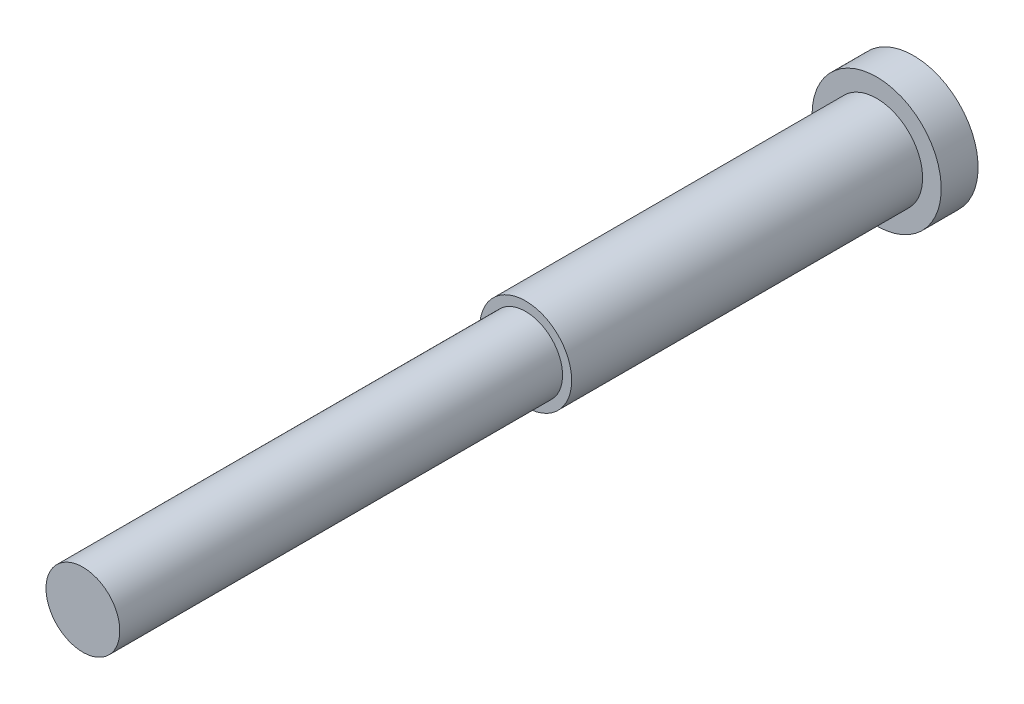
ISO-10303-21;
HEADER;
FILE_DESCRIPTION(('STEP AP214'),'2;1');
FILE_NAME('part.step','',(''),(''),'','','');
FILE_SCHEMA(('AUTOMOTIVE_DESIGN { 1 0 10303 214 1 1 1 1 }'));
ENDSEC;
DATA;
#1=APPLICATION_CONTEXT('core data for automotive mechanical design processes');
#2=APPLICATION_PROTOCOL_DEFINITION('international standard','automotive_design',2000,#1);
#3=PRODUCT_CONTEXT('',#1,'mechanical');
#4=PRODUCT('Part','Part','',(#3));
#5=PRODUCT_RELATED_PRODUCT_CATEGORY('part','',(#4));
#6=PRODUCT_DEFINITION_FORMATION('','',#4);
#7=PRODUCT_DEFINITION_CONTEXT('part definition',#1,'design');
#8=PRODUCT_DEFINITION('design','',#6,#7);
#9=PRODUCT_DEFINITION_SHAPE('','',#8);
#10=(LENGTH_UNIT() NAMED_UNIT(*) SI_UNIT(.MILLI.,.METRE.));
#11=(NAMED_UNIT(*) PLANE_ANGLE_UNIT() SI_UNIT($,.RADIAN.));
#12=(NAMED_UNIT(*) SI_UNIT($,.STERADIAN.) SOLID_ANGLE_UNIT());
#13=UNCERTAINTY_MEASURE_WITH_UNIT(LENGTH_MEASURE(1.E-05),#10,'distance_accuracy_value','');
#14=(GEOMETRIC_REPRESENTATION_CONTEXT(3) GLOBAL_UNCERTAINTY_ASSIGNED_CONTEXT((#13)) GLOBAL_UNIT_ASSIGNED_CONTEXT((#10,
#11,#12)) REPRESENTATION_CONTEXT('',''));
#15=CARTESIAN_POINT('',(0.,0.,0.));
#16=DIRECTION('',(0.,0.,1.));
#17=DIRECTION('',(1.,0.,0.));
#18=AXIS2_PLACEMENT_3D('',#15,#16,#17);
#19=CARTESIAN_POINT('',(0.,0.,60.4012));
#20=DIRECTION('',(0.,0.,1.));
#21=DIRECTION('',(1.,0.,0.));
#22=AXIS2_PLACEMENT_3D('',#19,#20,#21);
#23=PLANE('',#22);
#24=CARTESIAN_POINT('',(0.,0.,60.4012));
#25=DIRECTION('',(0.,0.,1.));
#26=DIRECTION('',(1.,0.,0.));
#27=AXIS2_PLACEMENT_3D('',#24,#25,#26);
#28=CIRCLE('',#27,7.9121);
#29=CARTESIAN_POINT('',(7.9121,0.,60.4012));
#30=VERTEX_POINT('',#29);
#31=EDGE_CURVE('E10',#30,#30,#28,.T.);
#32=ORIENTED_EDGE('',*,*,#31,.T.);
#33=EDGE_LOOP('',(#32));
#34=FACE_BOUND('',#33,.T.);
#35=CARTESIAN_POINT('',(0.,0.,60.4012));
#36=DIRECTION('',(0.,0.,1.));
#37=DIRECTION('',(1.,0.,0.));
#38=AXIS2_PLACEMENT_3D('',#35,#36,#37);
#39=CIRCLE('',#38,6.35);
#40=CARTESIAN_POINT('',(-6.35,0.,60.4012));
#41=VERTEX_POINT('',#40);
#42=EDGE_CURVE('E38',#41,#41,#39,.T.);
#43=ORIENTED_EDGE('',*,*,#42,.F.);
#44=EDGE_LOOP('',(#43));
#45=FACE_BOUND('',#44,.T.);
#46=ADVANCED_FACE('F27',(#34,#45),#23,.T.);
#47=CARTESIAN_POINT('',(0.,0.,60.4012));
#48=DIRECTION('',(0.,0.,-1.));
#49=DIRECTION('',(-1.,0.,0.));
#50=AXIS2_PLACEMENT_3D('',#47,#48,#49);
#51=CYLINDRICAL_SURFACE('',#50,7.9121);
#52=ORIENTED_EDGE('',*,*,#31,.F.);
#53=EDGE_LOOP('',(#52));
#54=FACE_BOUND('',#53,.T.);
#55=CARTESIAN_POINT('',(0.,0.,0.));
#56=DIRECTION('',(0.,0.,-1.));
#57=DIRECTION('',(-1.,0.,0.));
#58=AXIS2_PLACEMENT_3D('',#55,#56,#57);
#59=CIRCLE('',#58,7.9121);
#60=CARTESIAN_POINT('',(-7.9121,0.,0.));
#61=VERTEX_POINT('',#60);
#62=EDGE_CURVE('E42',#61,#61,#59,.T.);
#63=ORIENTED_EDGE('',*,*,#62,.F.);
#64=EDGE_LOOP('',(#63));
#65=FACE_BOUND('',#64,.T.);
#66=ADVANCED_FACE('F29',(#54,#65),#51,.T.);
#67=CARTESIAN_POINT('',(0.,0.,136.6012));
#68=DIRECTION('',(0.,0.,-1.));
#69=DIRECTION('',(-1.,0.,0.));
#70=AXIS2_PLACEMENT_3D('',#67,#68,#69);
#71=CYLINDRICAL_SURFACE('',#70,6.35);
#72=CARTESIAN_POINT('',(0.,0.,136.6012));
#73=DIRECTION('',(0.,0.,1.));
#74=DIRECTION('',(1.,0.,0.));
#75=AXIS2_PLACEMENT_3D('',#72,#73,#74);
#76=CIRCLE('',#75,6.35);
#77=CARTESIAN_POINT('',(-6.35,0.,136.6012));
#78=VERTEX_POINT('',#77);
#79=EDGE_CURVE('E34',#78,#78,#76,.T.);
#80=CARTESIAN_POINT('',(-6.35,0.,136.6012));
#81=CARTESIAN_POINT('',(-6.35,0.,135.80745));
#82=CARTESIAN_POINT('',(-6.35,0.,135.0137));
#83=CARTESIAN_POINT('',(-6.35,0.,133.4262));
#84=CARTESIAN_POINT('',(-6.35,0.,132.63245));
#85=CARTESIAN_POINT('',(-6.35,0.,131.04495));
#86=CARTESIAN_POINT('',(-6.35,0.,130.2512));
#87=CARTESIAN_POINT('',(-6.35,0.,128.6637));
#88=CARTESIAN_POINT('',(-6.35,0.,127.86995));
#89=CARTESIAN_POINT('',(-6.35,0.,126.28245));
#90=CARTESIAN_POINT('',(-6.35,0.,125.4887));
#91=CARTESIAN_POINT('',(-6.35,0.,123.9012));
#92=CARTESIAN_POINT('',(-6.35,0.,123.10745));
#93=CARTESIAN_POINT('',(-6.35,0.,121.51995));
#94=CARTESIAN_POINT('',(-6.35,0.,120.7262));
#95=CARTESIAN_POINT('',(-6.35,0.,119.1387));
#96=CARTESIAN_POINT('',(-6.35,0.,118.34495));
#97=CARTESIAN_POINT('',(-6.35,0.,116.75745));
#98=CARTESIAN_POINT('',(-6.35,0.,115.9637));
#99=CARTESIAN_POINT('',(-6.35,0.,114.3762));
#100=CARTESIAN_POINT('',(-6.35,0.,113.58245));
#101=CARTESIAN_POINT('',(-6.35,0.,111.99495));
#102=CARTESIAN_POINT('',(-6.35,0.,111.2012));
#103=CARTESIAN_POINT('',(-6.35,0.,109.6137));
#104=CARTESIAN_POINT('',(-6.35,0.,108.81995));
#105=CARTESIAN_POINT('',(-6.35,0.,107.23245));
#106=CARTESIAN_POINT('',(-6.35,0.,106.4387));
#107=CARTESIAN_POINT('',(-6.35,0.,104.8512));
#108=CARTESIAN_POINT('',(-6.35,0.,104.05745));
#109=CARTESIAN_POINT('',(-6.35,0.,102.46995));
#110=CARTESIAN_POINT('',(-6.35,0.,101.6762));
#111=CARTESIAN_POINT('',(-6.35,0.,100.0887));
#112=CARTESIAN_POINT('',(-6.35,0.,99.29495));
#113=CARTESIAN_POINT('',(-6.35,0.,97.70745));
#114=CARTESIAN_POINT('',(-6.35,0.,96.9137));
#115=CARTESIAN_POINT('',(-6.35,0.,95.3262));
#116=CARTESIAN_POINT('',(-6.35,0.,94.53245));
#117=CARTESIAN_POINT('',(-6.35,0.,92.94495));
#118=CARTESIAN_POINT('',(-6.35,0.,92.1512));
#119=CARTESIAN_POINT('',(-6.35,0.,90.5637));
#120=CARTESIAN_POINT('',(-6.35,0.,89.76995));
#121=CARTESIAN_POINT('',(-6.35,0.,88.18245));
#122=CARTESIAN_POINT('',(-6.35,0.,87.3887));
#123=CARTESIAN_POINT('',(-6.35,0.,85.8012));
#124=CARTESIAN_POINT('',(-6.35,0.,85.00745));
#125=CARTESIAN_POINT('',(-6.35,0.,83.41995));
#126=CARTESIAN_POINT('',(-6.35,0.,82.6262));
#127=CARTESIAN_POINT('',(-6.35,0.,81.0387));
#128=CARTESIAN_POINT('',(-6.35,0.,80.24495));
#129=CARTESIAN_POINT('',(-6.35,0.,78.65745));
#130=CARTESIAN_POINT('',(-6.35,0.,77.8637));
#131=CARTESIAN_POINT('',(-6.35,0.,76.2762));
#132=CARTESIAN_POINT('',(-6.35,0.,75.48245));
#133=CARTESIAN_POINT('',(-6.35,0.,73.89495));
#134=CARTESIAN_POINT('',(-6.35,0.,73.1012));
#135=CARTESIAN_POINT('',(-6.35,0.,71.5137));
#136=CARTESIAN_POINT('',(-6.35,0.,70.71995));
#137=CARTESIAN_POINT('',(-6.35,0.,69.13245));
#138=CARTESIAN_POINT('',(-6.35,0.,68.3387));
#139=CARTESIAN_POINT('',(-6.35,0.,66.7512));
#140=CARTESIAN_POINT('',(-6.35,0.,65.95745));
#141=CARTESIAN_POINT('',(-6.35,0.,64.36995));
#142=CARTESIAN_POINT('',(-6.35,0.,63.5762));
#143=CARTESIAN_POINT('',(-6.35,0.,61.9887));
#144=CARTESIAN_POINT('',(-6.35,0.,61.19495));
#145=CARTESIAN_POINT('',(-6.35,0.,60.4012));
#146=B_SPLINE_CURVE_WITH_KNOTS('',3,(#80,#81,#82,#83,#84,#85,#86,#87,#88,#89,#90,#91,#92,#93,
#94,#95,#96,#97,#98,#99,#100,#101,#102,#103,#104,#105,#106,#107,#108,#109,#110,#111,#112,#113,
#114,#115,#116,#117,#118,#119,#120,#121,#122,#123,#124,#125,#126,#127,#128,#129,#130,#131,#132,
#133,#134,#135,#136,#137,#138,#139,#140,#141,#142,#143,#144,#145),.UNSPECIFIED.,.F.,.F.,(4,2,2,
2,2,2,2,2,2,2,2,2,2,2,2,2,2,2,2,2,2,2,2,2,2,2,2,2,2,2,2,2,4),(0.,2.38124999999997,
4.76249999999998,7.14374999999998,9.52499999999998,11.90625,14.2875,16.66875,19.05,21.43125,
23.8125,26.19375,28.575,30.95625,33.3375,35.71875,38.1,40.48125,42.8625,45.24375,47.625,
50.00625,52.3875,54.76875,57.15,59.53125,61.9125,64.29375,66.675,69.05625,71.4375,73.81875,
76.2),.UNSPECIFIED.);
#147=EDGE_CURVE('BSEAM64',#78,#41,#146,.T.);
#148=ORIENTED_EDGE('',*,*,#79,.F.);
#149=ORIENTED_EDGE('',*,*,#42,.T.);
#150=ORIENTED_EDGE('',*,*,#147,.T.);
#151=ORIENTED_EDGE('',*,*,#147,.F.);
#152=EDGE_LOOP('',(#148,#150,#149,#151));
#153=FACE_BOUND('',#152,.T.);
#154=ADVANCED_FACE('F64',(#153),#71,.T.);
#155=CARTESIAN_POINT('',(0.,0.,136.6012));
#156=DIRECTION('',(0.,0.,1.));
#157=DIRECTION('',(1.,0.,0.));
#158=AXIS2_PLACEMENT_3D('',#155,#156,#157);
#159=PLANE('',#158);
#160=ORIENTED_EDGE('',*,*,#79,.T.);
#161=EDGE_LOOP('',(#160));
#162=FACE_BOUND('',#161,.T.);
#163=ADVANCED_FACE('F59',(#162),#159,.T.);
#164=CARTESIAN_POINT('',(0.,0.,0.));
#165=DIRECTION('',(0.,0.,-1.));
#166=DIRECTION('',(-1.,0.,0.));
#167=AXIS2_PLACEMENT_3D('',#164,#165,#166);
#168=PLANE('',#167);
#169=CARTESIAN_POINT('',(0.,0.,0.));
#170=DIRECTION('',(0.,0.,-1.));
#171=DIRECTION('',(-1.,0.,0.));
#172=AXIS2_PLACEMENT_3D('',#169,#170,#171);
#173=CIRCLE('',#172,11.1125);
#174=CARTESIAN_POINT('',(-11.1125,0.,0.));
#175=VERTEX_POINT('',#174);
#176=EDGE_CURVE('E50',#175,#175,#173,.T.);
#177=ORIENTED_EDGE('',*,*,#176,.F.);
#178=EDGE_LOOP('',(#177));
#179=FACE_BOUND('',#178,.T.);
#180=ORIENTED_EDGE('',*,*,#62,.T.);
#181=EDGE_LOOP('',(#180));
#182=FACE_BOUND('',#181,.T.);
#183=ADVANCED_FACE('F56',(#179,#182),#168,.F.);
#184=CARTESIAN_POINT('',(0.,0.,-6.35));
#185=DIRECTION('',(0.,0.,1.));
#186=DIRECTION('',(1.,0.,0.));
#187=AXIS2_PLACEMENT_3D('',#184,#185,#186);
#188=CYLINDRICAL_SURFACE('',#187,11.1125);
#189=CARTESIAN_POINT('',(0.,0.,-6.35));
#190=DIRECTION('',(0.,0.,-1.));
#191=DIRECTION('',(-1.,0.,0.));
#192=AXIS2_PLACEMENT_3D('',#189,#190,#191);
#193=CIRCLE('',#192,11.1125);
#194=CARTESIAN_POINT('',(-11.1125,0.,-6.35));
#195=VERTEX_POINT('',#194);
#196=EDGE_CURVE('E47',#195,#195,#193,.T.);
#197=ORIENTED_EDGE('',*,*,#196,.F.);
#198=EDGE_LOOP('',(#197));
#199=FACE_BOUND('',#198,.T.);
#200=ORIENTED_EDGE('',*,*,#176,.T.);
#201=EDGE_LOOP('',(#200));
#202=FACE_BOUND('',#201,.T.);
#203=ADVANCED_FACE('F54',(#199,#202),#188,.T.);
#204=CARTESIAN_POINT('',(0.,0.,-6.35));
#205=DIRECTION('',(0.,0.,-1.));
#206=DIRECTION('',(-1.,0.,0.));
#207=AXIS2_PLACEMENT_3D('',#204,#205,#206);
#208=PLANE('',#207);
#209=ORIENTED_EDGE('',*,*,#196,.T.);
#210=EDGE_LOOP('',(#209));
#211=FACE_BOUND('',#210,.T.);
#212=ADVANCED_FACE('F80',(#211),#208,.T.);
#213=CLOSED_SHELL('',(#46,#66,#154,#163,#183,#203,#212));
#214=MANIFOLD_SOLID_BREP('B2',#213);
#215=ADVANCED_BREP_SHAPE_REPRESENTATION('',(#18,#214),#14);
#216=SHAPE_DEFINITION_REPRESENTATION(#9,#215);
ENDSEC;
END-ISO-10303-21;
